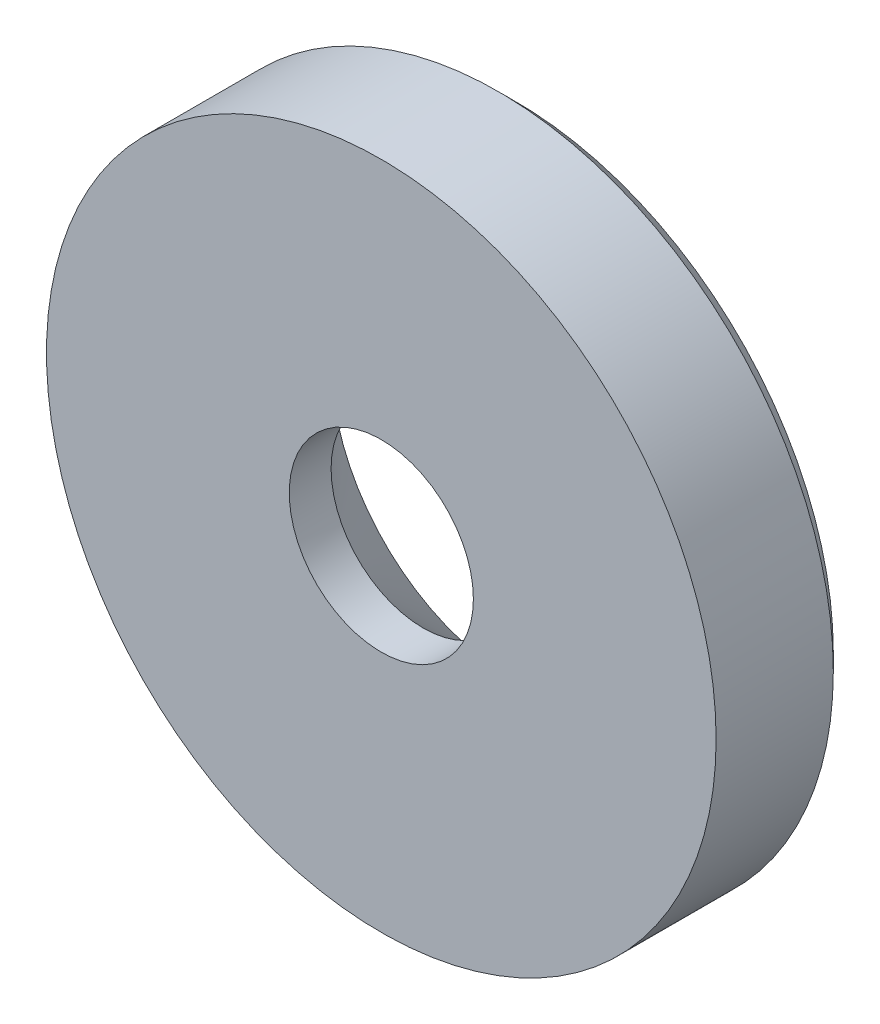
from build123d import *

# Parameters (mm, degrees)
SKETCH1_R          = 10
SKETCH1_R_2        = 2.75
BASE_EXTRUDE_DEPTH = 4
CHAMFER1_SIZE      = 0.5


with BuildPart() as part:
    # Sketch1 → Base-Extrude (new body)
    with BuildSketch(Plane.XY):
        Circle(SKETCH1_R)
        Circle(SKETCH1_R_2, mode=Mode.SUBTRACT)
    extrude(amount=-BASE_EXTRUDE_DEPTH)

    # Sketch2 → Cut-Revolve1 (revolve, cut)
    with BuildSketch(Plane(origin=(0, 0, 0), x_dir=(1, 0, 0), z_dir=(0, 1, 0)), mode=Mode.PRIVATE) as cut_revolve1_sk:
        Polygon((-5.5, 4), (-2.75, 4), (-2.75, 1.25), align=None)
    revolve(cut_revolve1_sk.sketch.rotate(Axis((0, 0, -8.465583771), (0, 0, 1)), 180), axis=Axis((0, 0, -8.465583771), (0, 0, 1)), mode=Mode.SUBTRACT)

    # Chamfer1
    chamfer1_edges = [part.edges().sort_by_distance(p)[0] for p in [
        (-10, 0, -4),
    ]]
    chamfer(chamfer1_edges, length=CHAMFER1_SIZE)


solid = part.part
